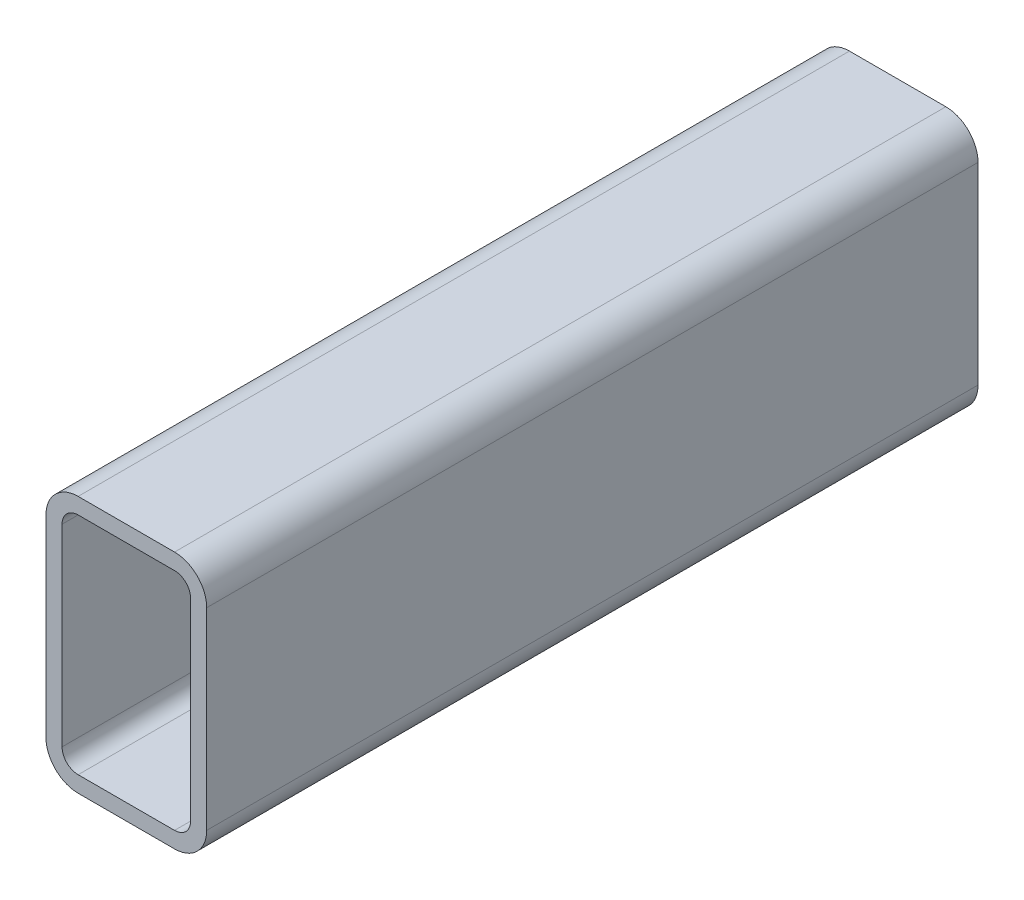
ISO-10303-21;
HEADER;
FILE_DESCRIPTION(('STEP AP214'),'2;1');
FILE_NAME('part.step','',(''),(''),'','','');
FILE_SCHEMA(('AUTOMOTIVE_DESIGN { 1 0 10303 214 1 1 1 1 }'));
ENDSEC;
DATA;
#1=APPLICATION_CONTEXT('core data for automotive mechanical design processes');
#2=APPLICATION_PROTOCOL_DEFINITION('international standard','automotive_design',2000,#1);
#3=PRODUCT_CONTEXT('',#1,'mechanical');
#4=PRODUCT('Part','Part','',(#3));
#5=PRODUCT_RELATED_PRODUCT_CATEGORY('part','',(#4));
#6=PRODUCT_DEFINITION_FORMATION('','',#4);
#7=PRODUCT_DEFINITION_CONTEXT('part definition',#1,'design');
#8=PRODUCT_DEFINITION('design','',#6,#7);
#9=PRODUCT_DEFINITION_SHAPE('','',#8);
#10=(LENGTH_UNIT() NAMED_UNIT(*) SI_UNIT(.MILLI.,.METRE.));
#11=(NAMED_UNIT(*) PLANE_ANGLE_UNIT() SI_UNIT($,.RADIAN.));
#12=(NAMED_UNIT(*) SI_UNIT($,.STERADIAN.) SOLID_ANGLE_UNIT());
#13=UNCERTAINTY_MEASURE_WITH_UNIT(LENGTH_MEASURE(1.E-05),#10,'distance_accuracy_value','');
#14=(GEOMETRIC_REPRESENTATION_CONTEXT(3) GLOBAL_UNCERTAINTY_ASSIGNED_CONTEXT((#13)) GLOBAL_UNIT_ASSIGNED_CONTEXT((#10,
#11,#12)) REPRESENTATION_CONTEXT('',''));
#15=CARTESIAN_POINT('',(0.,0.,0.));
#16=DIRECTION('',(0.,0.,1.));
#17=DIRECTION('',(1.,0.,0.));
#18=AXIS2_PLACEMENT_3D('',#15,#16,#17);
#19=CARTESIAN_POINT('',(15.5960851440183,90.9577651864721,304.8));
#20=DIRECTION('',(0.,0.,1.));
#21=DIRECTION('',(1.,0.,0.));
#22=AXIS2_PLACEMENT_3D('',#19,#20,#21);
#23=PLANE('',#22);
#24=CARTESIAN_POINT('',(15.5960851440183,90.9577651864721,304.8));
#25=DIRECTION('',(0.,0.,1.));
#26=DIRECTION('',(1.,0.,0.));
#27=AXIS2_PLACEMENT_3D('',#24,#25,#26);
#28=CIRCLE('',#27,12.7);
#29=CARTESIAN_POINT('',(15.5960851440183,103.657765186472,304.8));
#30=VERTEX_POINT('',#29);
#31=CARTESIAN_POINT('',(2.89608514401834,90.9577651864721,304.8));
#32=VERTEX_POINT('',#31);
#33=EDGE_CURVE('E211',#30,#32,#28,.T.);
#34=ORIENTED_EDGE('',*,*,#33,.T.);
#35=DIRECTION('',(0.,-1.,0.));
#36=VECTOR('',#35,1.);
#37=CARTESIAN_POINT('',(2.89608514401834,14.7577651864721,304.8));
#38=LINE('',#37,#36);
#39=CARTESIAN_POINT('',(2.89608514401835,14.7577651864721,304.8));
#40=VERTEX_POINT('',#39);
#41=EDGE_CURVE('E214',#32,#40,#38,.T.);
#42=ORIENTED_EDGE('',*,*,#41,.T.);
#43=CARTESIAN_POINT('',(15.5960851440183,14.7577651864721,304.8));
#44=DIRECTION('',(0.,0.,1.));
#45=DIRECTION('',(1.,0.,0.));
#46=AXIS2_PLACEMENT_3D('',#43,#44,#45);
#47=CIRCLE('',#46,12.7);
#48=CARTESIAN_POINT('',(15.5960851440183,2.05776518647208,304.8));
#49=VERTEX_POINT('',#48);
#50=EDGE_CURVE('E217',#40,#49,#47,.T.);
#51=ORIENTED_EDGE('',*,*,#50,.T.);
#52=DIRECTION('',(1.,0.,0.));
#53=VECTOR('',#52,1.);
#54=CARTESIAN_POINT('',(53.6960851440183,2.05776518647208,304.8));
#55=LINE('',#54,#53);
#56=CARTESIAN_POINT('',(53.6960851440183,2.05776518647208,304.8));
#57=VERTEX_POINT('',#56);
#58=EDGE_CURVE('E219',#49,#57,#55,.T.);
#59=ORIENTED_EDGE('',*,*,#58,.T.);
#60=CARTESIAN_POINT('',(53.6960851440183,14.7577651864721,304.8));
#61=DIRECTION('',(0.,0.,1.));
#62=DIRECTION('',(1.,0.,0.));
#63=AXIS2_PLACEMENT_3D('',#60,#61,#62);
#64=CIRCLE('',#63,12.7);
#65=CARTESIAN_POINT('',(66.3960851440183,14.7577651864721,304.8));
#66=VERTEX_POINT('',#65);
#67=EDGE_CURVE('E221',#57,#66,#64,.T.);
#68=ORIENTED_EDGE('',*,*,#67,.T.);
#69=DIRECTION('',(0.,1.,0.));
#70=VECTOR('',#69,1.);
#71=CARTESIAN_POINT('',(66.3960851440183,90.9577651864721,304.8));
#72=LINE('',#71,#70);
#73=CARTESIAN_POINT('',(66.3960851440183,90.9577651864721,304.8));
#74=VERTEX_POINT('',#73);
#75=EDGE_CURVE('E223',#66,#74,#72,.T.);
#76=ORIENTED_EDGE('',*,*,#75,.T.);
#77=CARTESIAN_POINT('',(53.6960851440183,90.9577651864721,304.8));
#78=DIRECTION('',(0.,0.,1.));
#79=DIRECTION('',(1.,0.,0.));
#80=AXIS2_PLACEMENT_3D('',#77,#78,#79);
#81=CIRCLE('',#80,12.7);
#82=CARTESIAN_POINT('',(53.6960851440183,103.657765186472,304.8));
#83=VERTEX_POINT('',#82);
#84=EDGE_CURVE('E225',#74,#83,#81,.T.);
#85=ORIENTED_EDGE('',*,*,#84,.T.);
#86=DIRECTION('',(-1.,0.,0.));
#87=VECTOR('',#86,1.);
#88=CARTESIAN_POINT('',(15.5960851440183,103.657765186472,304.8));
#89=LINE('',#88,#87);
#90=EDGE_CURVE('E227',#83,#30,#89,.T.);
#91=ORIENTED_EDGE('',*,*,#90,.T.);
#92=EDGE_LOOP('',(#34,#42,#51,#59,#68,#76,#85,#91));
#93=FACE_BOUND('',#92,.T.);
#94=DIRECTION('',(0.,-1.,0.));
#95=VECTOR('',#94,1.);
#96=CARTESIAN_POINT('',(9.24608514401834,14.7577651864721,304.8));
#97=LINE('',#96,#95);
#98=CARTESIAN_POINT('',(9.24608514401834,90.9577651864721,304.8));
#99=VERTEX_POINT('',#98);
#100=CARTESIAN_POINT('',(9.24608514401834,14.7577651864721,304.8));
#101=VERTEX_POINT('',#100);
#102=EDGE_CURVE('E154',#99,#101,#97,.T.);
#103=ORIENTED_EDGE('',*,*,#102,.F.);
#104=CARTESIAN_POINT('',(15.5960851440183,90.9577651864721,304.8));
#105=DIRECTION('',(0.,0.,1.));
#106=DIRECTION('',(1.,0.,0.));
#107=AXIS2_PLACEMENT_3D('',#104,#105,#106);
#108=CIRCLE('',#107,6.35000000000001);
#109=CARTESIAN_POINT('',(15.5960851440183,97.3077651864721,304.8));
#110=VERTEX_POINT('',#109);
#111=EDGE_CURVE('E146',#110,#99,#108,.T.);
#112=ORIENTED_EDGE('',*,*,#111,.F.);
#113=DIRECTION('',(-1.,0.,0.));
#114=VECTOR('',#113,1.);
#115=CARTESIAN_POINT('',(15.5960851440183,97.3077651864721,304.8));
#116=LINE('',#115,#114);
#117=CARTESIAN_POINT('',(53.6960851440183,97.3077651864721,304.8));
#118=VERTEX_POINT('',#117);
#119=EDGE_CURVE('E179',#118,#110,#116,.T.);
#120=ORIENTED_EDGE('',*,*,#119,.F.);
#121=CARTESIAN_POINT('',(53.6960851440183,90.9577651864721,304.8));
#122=DIRECTION('',(0.,0.,1.));
#123=DIRECTION('',(1.,0.,0.));
#124=AXIS2_PLACEMENT_3D('',#121,#122,#123);
#125=CIRCLE('',#124,6.35000000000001);
#126=CARTESIAN_POINT('',(60.0460851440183,90.9577651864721,304.8));
#127=VERTEX_POINT('',#126);
#128=EDGE_CURVE('E177',#127,#118,#125,.T.);
#129=ORIENTED_EDGE('',*,*,#128,.F.);
#130=DIRECTION('',(0.,1.,0.));
#131=VECTOR('',#130,1.);
#132=CARTESIAN_POINT('',(60.0460851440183,90.9577651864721,304.8));
#133=LINE('',#132,#131);
#134=CARTESIAN_POINT('',(60.0460851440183,14.7577651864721,304.8));
#135=VERTEX_POINT('',#134);
#136=EDGE_CURVE('E175',#135,#127,#133,.T.);
#137=ORIENTED_EDGE('',*,*,#136,.F.);
#138=CARTESIAN_POINT('',(53.6960851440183,14.7577651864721,304.8));
#139=DIRECTION('',(0.,0.,1.));
#140=DIRECTION('',(1.,0.,0.));
#141=AXIS2_PLACEMENT_3D('',#138,#139,#140);
#142=CIRCLE('',#141,6.35000000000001);
#143=CARTESIAN_POINT('',(53.6960851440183,8.40776518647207,304.8));
#144=VERTEX_POINT('',#143);
#145=EDGE_CURVE('E173',#144,#135,#142,.T.);
#146=ORIENTED_EDGE('',*,*,#145,.F.);
#147=DIRECTION('',(1.,0.,0.));
#148=VECTOR('',#147,1.);
#149=CARTESIAN_POINT('',(53.6960851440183,8.40776518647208,304.8));
#150=LINE('',#149,#148);
#151=CARTESIAN_POINT('',(15.5960851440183,8.40776518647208,304.8));
#152=VERTEX_POINT('',#151);
#153=EDGE_CURVE('E169',#152,#144,#150,.T.);
#154=ORIENTED_EDGE('',*,*,#153,.F.);
#155=CARTESIAN_POINT('',(15.5960851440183,14.7577651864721,304.8));
#156=DIRECTION('',(0.,0.,1.));
#157=DIRECTION('',(1.,0.,0.));
#158=AXIS2_PLACEMENT_3D('',#155,#156,#157);
#159=CIRCLE('',#158,6.35);
#160=EDGE_CURVE('E167',#101,#152,#159,.T.);
#161=ORIENTED_EDGE('',*,*,#160,.F.);
#162=EDGE_LOOP('',(#103,#112,#120,#129,#137,#146,#154,#161));
#163=FACE_BOUND('',#162,.T.);
#164=ADVANCED_FACE('F33',(#93,#163),#23,.T.);
#165=CARTESIAN_POINT('',(15.5960851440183,90.9577651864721,0.));
#166=DIRECTION('',(0.,0.,1.));
#167=DIRECTION('',(1.,0.,0.));
#168=AXIS2_PLACEMENT_3D('',#165,#166,#167);
#169=PLANE('',#168);
#170=CARTESIAN_POINT('',(15.5960851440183,90.9577651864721,0.));
#171=DIRECTION('',(0.,0.,1.));
#172=DIRECTION('',(1.,0.,0.));
#173=AXIS2_PLACEMENT_3D('',#170,#171,#172);
#174=CIRCLE('',#173,12.7);
#175=CARTESIAN_POINT('',(15.5960851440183,103.657765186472,0.));
#176=VERTEX_POINT('',#175);
#177=CARTESIAN_POINT('',(2.89608514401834,90.9577651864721,0.));
#178=VERTEX_POINT('',#177);
#179=EDGE_CURVE('E162',#176,#178,#174,.T.);
#180=ORIENTED_EDGE('',*,*,#179,.F.);
#181=DIRECTION('',(-1.,0.,0.));
#182=VECTOR('',#181,1.);
#183=CARTESIAN_POINT('',(15.5960851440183,103.657765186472,0.));
#184=LINE('',#183,#182);
#185=CARTESIAN_POINT('',(53.6960851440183,103.657765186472,0.));
#186=VERTEX_POINT('',#185);
#187=EDGE_CURVE('E215',#186,#176,#184,.T.);
#188=ORIENTED_EDGE('',*,*,#187,.F.);
#189=CARTESIAN_POINT('',(53.6960851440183,90.9577651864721,0.));
#190=DIRECTION('',(0.,0.,1.));
#191=DIRECTION('',(1.,0.,0.));
#192=AXIS2_PLACEMENT_3D('',#189,#190,#191);
#193=CIRCLE('',#192,12.7);
#194=CARTESIAN_POINT('',(66.3960851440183,90.9577651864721,0.));
#195=VERTEX_POINT('',#194);
#196=EDGE_CURVE('E242',#195,#186,#193,.T.);
#197=ORIENTED_EDGE('',*,*,#196,.F.);
#198=DIRECTION('',(0.,1.,0.));
#199=VECTOR('',#198,1.);
#200=CARTESIAN_POINT('',(66.3960851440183,90.9577651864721,0.));
#201=LINE('',#200,#199);
#202=CARTESIAN_POINT('',(66.3960851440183,14.7577651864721,0.));
#203=VERTEX_POINT('',#202);
#204=EDGE_CURVE('E240',#203,#195,#201,.T.);
#205=ORIENTED_EDGE('',*,*,#204,.F.);
#206=CARTESIAN_POINT('',(53.6960851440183,14.7577651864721,0.));
#207=DIRECTION('',(0.,0.,1.));
#208=DIRECTION('',(1.,0.,0.));
#209=AXIS2_PLACEMENT_3D('',#206,#207,#208);
#210=CIRCLE('',#209,12.7);
#211=CARTESIAN_POINT('',(53.6960851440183,2.05776518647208,0.));
#212=VERTEX_POINT('',#211);
#213=EDGE_CURVE('E238',#212,#203,#210,.T.);
#214=ORIENTED_EDGE('',*,*,#213,.F.);
#215=DIRECTION('',(1.,0.,0.));
#216=VECTOR('',#215,1.);
#217=CARTESIAN_POINT('',(53.6960851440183,2.05776518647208,0.));
#218=LINE('',#217,#216);
#219=CARTESIAN_POINT('',(15.5960851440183,2.05776518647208,0.));
#220=VERTEX_POINT('',#219);
#221=EDGE_CURVE('E236',#220,#212,#218,.T.);
#222=ORIENTED_EDGE('',*,*,#221,.F.);
#223=CARTESIAN_POINT('',(15.5960851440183,14.7577651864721,0.));
#224=DIRECTION('',(0.,0.,1.));
#225=DIRECTION('',(1.,0.,0.));
#226=AXIS2_PLACEMENT_3D('',#223,#224,#225);
#227=CIRCLE('',#226,12.7);
#228=CARTESIAN_POINT('',(2.89608514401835,14.7577651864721,0.));
#229=VERTEX_POINT('',#228);
#230=EDGE_CURVE('E234',#229,#220,#227,.T.);
#231=ORIENTED_EDGE('',*,*,#230,.F.);
#232=DIRECTION('',(0.,-1.,0.));
#233=VECTOR('',#232,1.);
#234=CARTESIAN_POINT('',(2.89608514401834,14.7577651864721,0.));
#235=LINE('',#234,#233);
#236=EDGE_CURVE('E232',#178,#229,#235,.T.);
#237=ORIENTED_EDGE('',*,*,#236,.F.);
#238=EDGE_LOOP('',(#180,#188,#197,#205,#214,#222,#231,#237));
#239=FACE_BOUND('',#238,.T.);
#240=CARTESIAN_POINT('',(15.5960851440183,90.9577651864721,0.));
#241=DIRECTION('',(0.,0.,1.));
#242=DIRECTION('',(1.,0.,0.));
#243=AXIS2_PLACEMENT_3D('',#240,#241,#242);
#244=CIRCLE('',#243,6.35000000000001);
#245=CARTESIAN_POINT('',(15.5960851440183,97.3077651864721,0.));
#246=VERTEX_POINT('',#245);
#247=CARTESIAN_POINT('',(9.24608514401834,90.9577651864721,0.));
#248=VERTEX_POINT('',#247);
#249=EDGE_CURVE('E56',#246,#248,#244,.T.);
#250=ORIENTED_EDGE('',*,*,#249,.T.);
#251=DIRECTION('',(0.,-1.,0.));
#252=VECTOR('',#251,1.);
#253=CARTESIAN_POINT('',(9.24608514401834,14.7577651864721,0.));
#254=LINE('',#253,#252);
#255=CARTESIAN_POINT('',(9.24608514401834,14.7577651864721,0.));
#256=VERTEX_POINT('',#255);
#257=EDGE_CURVE('E161',#248,#256,#254,.T.);
#258=ORIENTED_EDGE('',*,*,#257,.T.);
#259=CARTESIAN_POINT('',(15.5960851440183,14.7577651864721,0.));
#260=DIRECTION('',(0.,0.,1.));
#261=DIRECTION('',(1.,0.,0.));
#262=AXIS2_PLACEMENT_3D('',#259,#260,#261);
#263=CIRCLE('',#262,6.35);
#264=CARTESIAN_POINT('',(15.5960851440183,8.40776518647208,0.));
#265=VERTEX_POINT('',#264);
#266=EDGE_CURVE('E183',#256,#265,#263,.T.);
#267=ORIENTED_EDGE('',*,*,#266,.T.);
#268=DIRECTION('',(1.,0.,0.));
#269=VECTOR('',#268,1.);
#270=CARTESIAN_POINT('',(53.6960851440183,8.40776518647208,0.));
#271=LINE('',#270,#269);
#272=CARTESIAN_POINT('',(53.6960851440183,8.40776518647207,0.));
#273=VERTEX_POINT('',#272);
#274=EDGE_CURVE('E186',#265,#273,#271,.T.);
#275=ORIENTED_EDGE('',*,*,#274,.T.);
#276=CARTESIAN_POINT('',(53.6960851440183,14.7577651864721,0.));
#277=DIRECTION('',(0.,0.,1.));
#278=DIRECTION('',(1.,0.,0.));
#279=AXIS2_PLACEMENT_3D('',#276,#277,#278);
#280=CIRCLE('',#279,6.35000000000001);
#281=CARTESIAN_POINT('',(60.0460851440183,14.7577651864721,0.));
#282=VERTEX_POINT('',#281);
#283=EDGE_CURVE('E189',#273,#282,#280,.T.);
#284=ORIENTED_EDGE('',*,*,#283,.T.);
#285=DIRECTION('',(0.,1.,0.));
#286=VECTOR('',#285,1.);
#287=CARTESIAN_POINT('',(60.0460851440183,90.9577651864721,0.));
#288=LINE('',#287,#286);
#289=CARTESIAN_POINT('',(60.0460851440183,90.9577651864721,0.));
#290=VERTEX_POINT('',#289);
#291=EDGE_CURVE('E192',#282,#290,#288,.T.);
#292=ORIENTED_EDGE('',*,*,#291,.T.);
#293=CARTESIAN_POINT('',(53.6960851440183,90.9577651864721,0.));
#294=DIRECTION('',(0.,0.,1.));
#295=DIRECTION('',(1.,0.,0.));
#296=AXIS2_PLACEMENT_3D('',#293,#294,#295);
#297=CIRCLE('',#296,6.35000000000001);
#298=CARTESIAN_POINT('',(53.6960851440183,97.3077651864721,0.));
#299=VERTEX_POINT('',#298);
#300=EDGE_CURVE('E195',#290,#299,#297,.T.);
#301=ORIENTED_EDGE('',*,*,#300,.T.);
#302=DIRECTION('',(-1.,0.,0.));
#303=VECTOR('',#302,1.);
#304=CARTESIAN_POINT('',(15.5960851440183,97.3077651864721,0.));
#305=LINE('',#304,#303);
#306=EDGE_CURVE('E155',#299,#246,#305,.T.);
#307=ORIENTED_EDGE('',*,*,#306,.T.);
#308=EDGE_LOOP('',(#250,#258,#267,#275,#284,#292,#301,#307));
#309=FACE_BOUND('',#308,.T.);
#310=ADVANCED_FACE('F272',(#239,#309),#169,.F.);
#311=CARTESIAN_POINT('',(15.5960851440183,90.9577651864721,304.8));
#312=DIRECTION('',(0.,0.,-1.));
#313=DIRECTION('',(-1.,0.,0.));
#314=AXIS2_PLACEMENT_3D('',#311,#312,#313);
#315=CYLINDRICAL_SURFACE('',#314,12.7);
#316=ORIENTED_EDGE('',*,*,#179,.T.);
#317=DIRECTION('',(0.,0.,-1.));
#318=VECTOR('',#317,1.);
#319=CARTESIAN_POINT('',(2.89608514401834,90.9577651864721,304.8));
#320=LINE('',#319,#318);
#321=EDGE_CURVE('E11',#32,#178,#320,.T.);
#322=ORIENTED_EDGE('',*,*,#321,.F.);
#323=ORIENTED_EDGE('',*,*,#33,.F.);
#324=DIRECTION('',(0.,0.,-1.));
#325=VECTOR('',#324,1.);
#326=CARTESIAN_POINT('',(15.5960851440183,103.657765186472,304.8));
#327=LINE('',#326,#325);
#328=EDGE_CURVE('E229',#30,#176,#327,.T.);
#329=ORIENTED_EDGE('',*,*,#328,.T.);
#330=EDGE_LOOP('',(#316,#322,#323,#329));
#331=FACE_BOUND('',#330,.T.);
#332=ADVANCED_FACE('F35',(#331),#315,.T.);
#333=CARTESIAN_POINT('',(2.89608514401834,14.7577651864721,304.8));
#334=DIRECTION('',(1.,0.,0.));
#335=DIRECTION('',(0.,0.,-1.));
#336=AXIS2_PLACEMENT_3D('',#333,#334,#335);
#337=PLANE('',#336);
#338=ORIENTED_EDGE('',*,*,#236,.T.);
#339=DIRECTION('',(0.,0.,-1.));
#340=VECTOR('',#339,1.);
#341=CARTESIAN_POINT('',(2.89608514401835,14.7577651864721,304.8));
#342=LINE('',#341,#340);
#343=EDGE_CURVE('E41',#40,#229,#342,.T.);
#344=ORIENTED_EDGE('',*,*,#343,.F.);
#345=ORIENTED_EDGE('',*,*,#41,.F.);
#346=ORIENTED_EDGE('',*,*,#321,.T.);
#347=EDGE_LOOP('',(#338,#344,#345,#346));
#348=FACE_BOUND('',#347,.T.);
#349=ADVANCED_FACE('F289',(#348),#337,.F.);
#350=CARTESIAN_POINT('',(15.5960851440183,14.7577651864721,304.8));
#351=DIRECTION('',(0.,0.,-1.));
#352=DIRECTION('',(-1.,0.,0.));
#353=AXIS2_PLACEMENT_3D('',#350,#351,#352);
#354=CYLINDRICAL_SURFACE('',#353,12.7);
#355=ORIENTED_EDGE('',*,*,#230,.T.);
#356=DIRECTION('',(0.,0.,-1.));
#357=VECTOR('',#356,1.);
#358=CARTESIAN_POINT('',(15.5960851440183,2.05776518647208,304.8));
#359=LINE('',#358,#357);
#360=EDGE_CURVE('E259',#49,#220,#359,.T.);
#361=ORIENTED_EDGE('',*,*,#360,.F.);
#362=ORIENTED_EDGE('',*,*,#50,.F.);
#363=ORIENTED_EDGE('',*,*,#343,.T.);
#364=EDGE_LOOP('',(#355,#361,#362,#363));
#365=FACE_BOUND('',#364,.T.);
#366=ADVANCED_FACE('F266',(#365),#354,.T.);
#367=CARTESIAN_POINT('',(53.6960851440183,2.05776518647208,304.8));
#368=DIRECTION('',(0.,1.,0.));
#369=DIRECTION('',(0.,0.,1.));
#370=AXIS2_PLACEMENT_3D('',#367,#368,#369);
#371=PLANE('',#370);
#372=ORIENTED_EDGE('',*,*,#221,.T.);
#373=DIRECTION('',(0.,0.,-1.));
#374=VECTOR('',#373,1.);
#375=CARTESIAN_POINT('',(53.6960851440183,2.05776518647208,304.8));
#376=LINE('',#375,#374);
#377=EDGE_CURVE('E256',#57,#212,#376,.T.);
#378=ORIENTED_EDGE('',*,*,#377,.F.);
#379=ORIENTED_EDGE('',*,*,#58,.F.);
#380=ORIENTED_EDGE('',*,*,#360,.T.);
#381=EDGE_LOOP('',(#372,#378,#379,#380));
#382=FACE_BOUND('',#381,.T.);
#383=ADVANCED_FACE('F278',(#382),#371,.F.);
#384=CARTESIAN_POINT('',(53.6960851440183,14.7577651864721,304.8));
#385=DIRECTION('',(0.,0.,-1.));
#386=DIRECTION('',(-1.,0.,0.));
#387=AXIS2_PLACEMENT_3D('',#384,#385,#386);
#388=CYLINDRICAL_SURFACE('',#387,12.7);
#389=ORIENTED_EDGE('',*,*,#213,.T.);
#390=DIRECTION('',(0.,0.,-1.));
#391=VECTOR('',#390,1.);
#392=CARTESIAN_POINT('',(66.3960851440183,14.7577651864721,304.8));
#393=LINE('',#392,#391);
#394=EDGE_CURVE('E253',#66,#203,#393,.T.);
#395=ORIENTED_EDGE('',*,*,#394,.F.);
#396=ORIENTED_EDGE('',*,*,#67,.F.);
#397=ORIENTED_EDGE('',*,*,#377,.T.);
#398=EDGE_LOOP('',(#389,#395,#396,#397));
#399=FACE_BOUND('',#398,.T.);
#400=ADVANCED_FACE('F282',(#399),#388,.T.);
#401=CARTESIAN_POINT('',(66.3960851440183,90.9577651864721,304.8));
#402=DIRECTION('',(-1.,0.,0.));
#403=DIRECTION('',(0.,0.,1.));
#404=AXIS2_PLACEMENT_3D('',#401,#402,#403);
#405=PLANE('',#404);
#406=ORIENTED_EDGE('',*,*,#204,.T.);
#407=DIRECTION('',(0.,0.,-1.));
#408=VECTOR('',#407,1.);
#409=CARTESIAN_POINT('',(66.3960851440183,90.9577651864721,304.8));
#410=LINE('',#409,#408);
#411=EDGE_CURVE('E250',#74,#195,#410,.T.);
#412=ORIENTED_EDGE('',*,*,#411,.F.);
#413=ORIENTED_EDGE('',*,*,#75,.F.);
#414=ORIENTED_EDGE('',*,*,#394,.T.);
#415=EDGE_LOOP('',(#406,#412,#413,#414));
#416=FACE_BOUND('',#415,.T.);
#417=ADVANCED_FACE('F302',(#416),#405,.F.);
#418=CARTESIAN_POINT('',(53.6960851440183,90.9577651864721,304.8));
#419=DIRECTION('',(0.,0.,-1.));
#420=DIRECTION('',(-1.,0.,0.));
#421=AXIS2_PLACEMENT_3D('',#418,#419,#420);
#422=CYLINDRICAL_SURFACE('',#421,12.7);
#423=ORIENTED_EDGE('',*,*,#196,.T.);
#424=DIRECTION('',(0.,0.,-1.));
#425=VECTOR('',#424,1.);
#426=CARTESIAN_POINT('',(53.6960851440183,103.657765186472,304.8));
#427=LINE('',#426,#425);
#428=EDGE_CURVE('E247',#83,#186,#427,.T.);
#429=ORIENTED_EDGE('',*,*,#428,.F.);
#430=ORIENTED_EDGE('',*,*,#84,.F.);
#431=ORIENTED_EDGE('',*,*,#411,.T.);
#432=EDGE_LOOP('',(#423,#429,#430,#431));
#433=FACE_BOUND('',#432,.T.);
#434=ADVANCED_FACE('F300',(#433),#422,.T.);
#435=CARTESIAN_POINT('',(15.5960851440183,103.657765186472,304.8));
#436=DIRECTION('',(0.,-1.,0.));
#437=DIRECTION('',(0.,0.,-1.));
#438=AXIS2_PLACEMENT_3D('',#435,#436,#437);
#439=PLANE('',#438);
#440=ORIENTED_EDGE('',*,*,#187,.T.);
#441=ORIENTED_EDGE('',*,*,#328,.F.);
#442=ORIENTED_EDGE('',*,*,#90,.F.);
#443=ORIENTED_EDGE('',*,*,#428,.T.);
#444=EDGE_LOOP('',(#440,#441,#442,#443));
#445=FACE_BOUND('',#444,.T.);
#446=ADVANCED_FACE('F295',(#445),#439,.F.);
#447=CARTESIAN_POINT('',(15.5960851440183,90.9577651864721,304.8));
#448=DIRECTION('',(0.,0.,-1.));
#449=DIRECTION('',(-1.,0.,0.));
#450=AXIS2_PLACEMENT_3D('',#447,#448,#449);
#451=CYLINDRICAL_SURFACE('',#450,6.35000000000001);
#452=ORIENTED_EDGE('',*,*,#249,.F.);
#453=DIRECTION('',(0.,0.,-1.));
#454=VECTOR('',#453,1.);
#455=CARTESIAN_POINT('',(15.5960851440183,97.3077651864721,304.8));
#456=LINE('',#455,#454);
#457=EDGE_CURVE('E150',#110,#246,#456,.T.);
#458=ORIENTED_EDGE('',*,*,#457,.F.);
#459=ORIENTED_EDGE('',*,*,#111,.T.);
#460=DIRECTION('',(0.,0.,-1.));
#461=VECTOR('',#460,1.);
#462=CARTESIAN_POINT('',(9.24608514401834,90.9577651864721,304.8));
#463=LINE('',#462,#461);
#464=EDGE_CURVE('E149',#99,#248,#463,.T.);
#465=ORIENTED_EDGE('',*,*,#464,.T.);
#466=EDGE_LOOP('',(#452,#458,#459,#465));
#467=FACE_BOUND('',#466,.T.);
#468=ADVANCED_FACE('F148',(#467),#451,.F.);
#469=CARTESIAN_POINT('',(9.24608514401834,14.7577651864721,304.8));
#470=DIRECTION('',(1.,0.,0.));
#471=DIRECTION('',(0.,0.,-1.));
#472=AXIS2_PLACEMENT_3D('',#469,#470,#471);
#473=PLANE('',#472);
#474=ORIENTED_EDGE('',*,*,#257,.F.);
#475=ORIENTED_EDGE('',*,*,#464,.F.);
#476=ORIENTED_EDGE('',*,*,#102,.T.);
#477=DIRECTION('',(0.,0.,-1.));
#478=VECTOR('',#477,1.);
#479=CARTESIAN_POINT('',(9.24608514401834,14.7577651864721,304.8));
#480=LINE('',#479,#478);
#481=EDGE_CURVE('E163',#101,#256,#480,.T.);
#482=ORIENTED_EDGE('',*,*,#481,.T.);
#483=EDGE_LOOP('',(#474,#475,#476,#482));
#484=FACE_BOUND('',#483,.T.);
#485=ADVANCED_FACE('F158',(#484),#473,.T.);
#486=CARTESIAN_POINT('',(15.5960851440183,14.7577651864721,304.8));
#487=DIRECTION('',(0.,0.,-1.));
#488=DIRECTION('',(-1.,0.,0.));
#489=AXIS2_PLACEMENT_3D('',#486,#487,#488);
#490=CYLINDRICAL_SURFACE('',#489,6.35);
#491=ORIENTED_EDGE('',*,*,#266,.F.);
#492=ORIENTED_EDGE('',*,*,#481,.F.);
#493=ORIENTED_EDGE('',*,*,#160,.T.);
#494=DIRECTION('',(0.,0.,-1.));
#495=VECTOR('',#494,1.);
#496=CARTESIAN_POINT('',(15.5960851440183,8.40776518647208,304.8));
#497=LINE('',#496,#495);
#498=EDGE_CURVE('E208',#152,#265,#497,.T.);
#499=ORIENTED_EDGE('',*,*,#498,.T.);
#500=EDGE_LOOP('',(#491,#492,#493,#499));
#501=FACE_BOUND('',#500,.T.);
#502=ADVANCED_FACE('F327',(#501),#490,.F.);
#503=CARTESIAN_POINT('',(53.6960851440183,8.40776518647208,304.8));
#504=DIRECTION('',(0.,1.,0.));
#505=DIRECTION('',(0.,0.,1.));
#506=AXIS2_PLACEMENT_3D('',#503,#504,#505);
#507=PLANE('',#506);
#508=ORIENTED_EDGE('',*,*,#274,.F.);
#509=ORIENTED_EDGE('',*,*,#498,.F.);
#510=ORIENTED_EDGE('',*,*,#153,.T.);
#511=DIRECTION('',(0.,0.,-1.));
#512=VECTOR('',#511,1.);
#513=CARTESIAN_POINT('',(53.6960851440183,8.40776518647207,304.8));
#514=LINE('',#513,#512);
#515=EDGE_CURVE('E206',#144,#273,#514,.T.);
#516=ORIENTED_EDGE('',*,*,#515,.T.);
#517=EDGE_LOOP('',(#508,#509,#510,#516));
#518=FACE_BOUND('',#517,.T.);
#519=ADVANCED_FACE('F331',(#518),#507,.T.);
#520=CARTESIAN_POINT('',(53.6960851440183,14.7577651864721,304.8));
#521=DIRECTION('',(0.,0.,-1.));
#522=DIRECTION('',(-1.,0.,0.));
#523=AXIS2_PLACEMENT_3D('',#520,#521,#522);
#524=CYLINDRICAL_SURFACE('',#523,6.35000000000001);
#525=ORIENTED_EDGE('',*,*,#283,.F.);
#526=ORIENTED_EDGE('',*,*,#515,.F.);
#527=ORIENTED_EDGE('',*,*,#145,.T.);
#528=DIRECTION('',(0.,0.,-1.));
#529=VECTOR('',#528,1.);
#530=CARTESIAN_POINT('',(60.0460851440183,14.7577651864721,304.8));
#531=LINE('',#530,#529);
#532=EDGE_CURVE('E204',#135,#282,#531,.T.);
#533=ORIENTED_EDGE('',*,*,#532,.T.);
#534=EDGE_LOOP('',(#525,#526,#527,#533));
#535=FACE_BOUND('',#534,.T.);
#536=ADVANCED_FACE('F337',(#535),#524,.F.);
#537=CARTESIAN_POINT('',(60.0460851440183,90.9577651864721,304.8));
#538=DIRECTION('',(-1.,0.,0.));
#539=DIRECTION('',(0.,0.,1.));
#540=AXIS2_PLACEMENT_3D('',#537,#538,#539);
#541=PLANE('',#540);
#542=ORIENTED_EDGE('',*,*,#291,.F.);
#543=ORIENTED_EDGE('',*,*,#532,.F.);
#544=ORIENTED_EDGE('',*,*,#136,.T.);
#545=DIRECTION('',(0.,0.,-1.));
#546=VECTOR('',#545,1.);
#547=CARTESIAN_POINT('',(60.0460851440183,90.9577651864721,304.8));
#548=LINE('',#547,#546);
#549=EDGE_CURVE('E202',#127,#290,#548,.T.);
#550=ORIENTED_EDGE('',*,*,#549,.T.);
#551=EDGE_LOOP('',(#542,#543,#544,#550));
#552=FACE_BOUND('',#551,.T.);
#553=ADVANCED_FACE('F341',(#552),#541,.T.);
#554=CARTESIAN_POINT('',(53.6960851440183,90.9577651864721,304.8));
#555=DIRECTION('',(0.,0.,-1.));
#556=DIRECTION('',(-1.,0.,0.));
#557=AXIS2_PLACEMENT_3D('',#554,#555,#556);
#558=CYLINDRICAL_SURFACE('',#557,6.35000000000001);
#559=ORIENTED_EDGE('',*,*,#300,.F.);
#560=ORIENTED_EDGE('',*,*,#549,.F.);
#561=ORIENTED_EDGE('',*,*,#128,.T.);
#562=DIRECTION('',(0.,0.,-1.));
#563=VECTOR('',#562,1.);
#564=CARTESIAN_POINT('',(53.6960851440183,97.3077651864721,304.8));
#565=LINE('',#564,#563);
#566=EDGE_CURVE('E48',#118,#299,#565,.T.);
#567=ORIENTED_EDGE('',*,*,#566,.T.);
#568=EDGE_LOOP('',(#559,#560,#561,#567));
#569=FACE_BOUND('',#568,.T.);
#570=ADVANCED_FACE('F345',(#569),#558,.F.);
#571=CARTESIAN_POINT('',(15.5960851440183,97.3077651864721,304.8));
#572=DIRECTION('',(0.,-1.,0.));
#573=DIRECTION('',(0.,0.,-1.));
#574=AXIS2_PLACEMENT_3D('',#571,#572,#573);
#575=PLANE('',#574);
#576=ORIENTED_EDGE('',*,*,#306,.F.);
#577=ORIENTED_EDGE('',*,*,#566,.F.);
#578=ORIENTED_EDGE('',*,*,#119,.T.);
#579=ORIENTED_EDGE('',*,*,#457,.T.);
#580=EDGE_LOOP('',(#576,#577,#578,#579));
#581=FACE_BOUND('',#580,.T.);
#582=ADVANCED_FACE('F349',(#581),#575,.T.);
#583=CLOSED_SHELL('',(#164,#310,#332,#349,#366,#383,#400,#417,#434,#446,#468,#485,#502,#519,
#536,#553,#570,#582));
#584=MANIFOLD_SOLID_BREP('B2',#583);
#585=ADVANCED_BREP_SHAPE_REPRESENTATION('',(#18,#584),#14);
#586=SHAPE_DEFINITION_REPRESENTATION(#9,#585);
ENDSEC;
END-ISO-10303-21;
